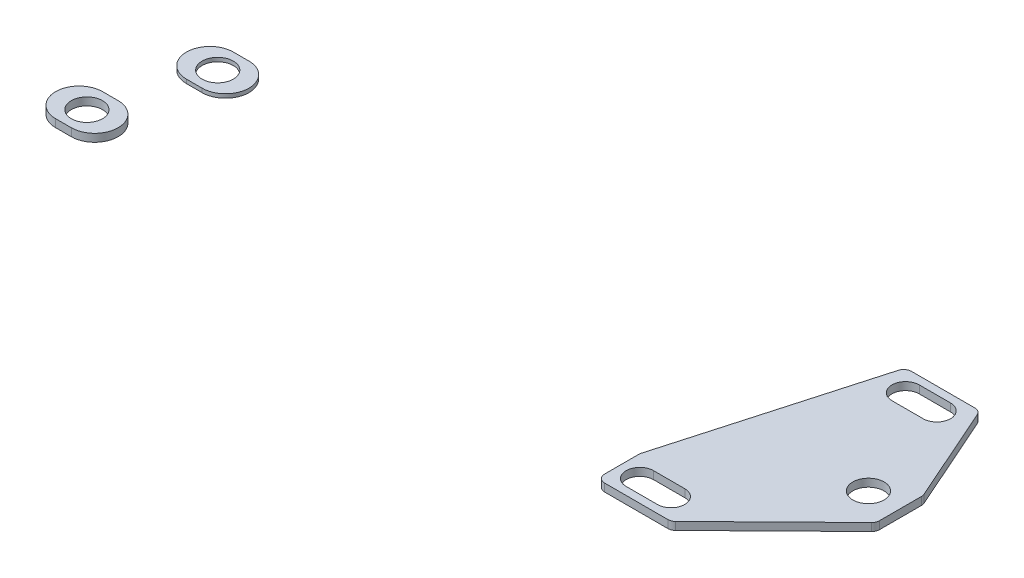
from build123d import *
from build123d.topology import SkipClean

# Parameters (mm, degrees)
AUFSATZ_LINEAR_AUSTRAGEN1_DEPTH   = 1
AUFSATZ_LINEAR_AUSTRAGEN2_DEPTH   = 1
AUFSATZ_LINEAR_AUSTRAGEN2_2_DEPTH = 1
AUFSATZ_LINEAR_AUSTRAGEN3_DEPTH   = 1
AUFSATZ_LINEAR_AUSTRAGEN3_2_DEPTH = 1
BOSS_EXTRUDE2_DEPTH               = 11
SKETCH3_W                         = 3
SKETCH3_H                         = 8
CUT_EXTRUDE2_DEPTH                = 1
SKETCH4_W                         = 3
SKETCH4_H                         = 8
CUT_EXTRUDE3_DEPTH                = 9
SKETCH6_W                         = 3
SKETCH6_H                         = 8
BOSS_EXTRUDE3_DEPTH               = 2
SKETCH8_W                         = 8
SKETCH8_H                         = 7
BOSS_EXTRUDE8_DEPTH               = 11
BOSS_EXTRUDE9_DEPTH               = 2
SKETCH9_W                         = 8
SKETCH9_H                         = 7
CUT_EXTRUDE4_DEPTH                = 11
SKETCH10_W                        = 3
SKETCH10_H                        = 8
BOSS_EXTRUDE10_DEPTH              = 2
SKETCH11_R                        = 3
CUT_EXTRUDE5_DEPTH                = 98.08758932
SKETCH12_R                        = 3
CUT_EXTRUDE6_DEPTH                = 98.473073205
SKETCH14_R                        = 3
CUT_EXTRUDE8_DEPTH                = 1
CUT_EXTRUDE9_DEPTH                = 98.205966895
FILLET3_R                         = 2
SKETCH18_W                        = 50.195530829
SKETCH18_H                        = 34.155605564
CUT_EXTRUDE10_DEPTH               = 1
SKETCH20_W                        = 50.179105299
SKETCH20_H                        = 58.102121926
CUT_EXTRUDE11_DEPTH               = 1
BOSS_EXTRUDE11_DEPTH              = 2
CUT_EXTRUDE12_DEPTH               = 2
SKETCH23_W                        = 35.69545505
SKETCH23_H                        = 16.05523492
CUT_EXTRUDE13_DEPTH               = 1
SKETCH24_R                        = 3
BOSS_EXTRUDE12_DEPTH              = 1
SKETCH25_R                        = 4
CUT_EXTRUDE14_DEPTH               = 102.959780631
SKETCH26_R                        = 4
BOSS_EXTRUDE13_DEPTH              = 5
BOSS_EXTRUDE14_DEPTH              = 1
BOSS_EXTRUDE14_DEPTH_BACK         = 1
SKETCH28_W                        = 16
SKETCH28_H                        = 12
CUT_EXTRUDE16_DEPTH               = 1
SKETCH29_R                        = 4
CUT_EXTRUDE17_DEPTH               = 103.668382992
CUT_EXTRUDE18_DEPTH               = 102.959780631
BOSS_EXTRUDE15_DEPTH              = 1
BOSS_EXTRUDE15_DEPTH_BACK         = 2
SKETCH33_W                        = 16
SKETCH33_H                        = 12
CUT_EXTRUDE19_DEPTH               = 1
SKETCH34_R                        = 4
SKETCH34_R_2                      = 3
CUT_EXTRUDE20_DEPTH               = 105.499401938
CUT_EXTRUDE22_DEPTH               = 281


with BuildPart() as part:
    # Trinity heel → Aufsatz-Linear austragen1 (new body)
    with BuildSketch(Plane(origin=(0, 0, 0), x_dir=(1, 0, 0), z_dir=(0, 1, 0))):
        with BuildLine():
            Line((-82, 3.5), (-74, 3.5))
            ThreePointArc((-74, 3.5), (-70.5, 0), (-74, -3.5))
            Line((-74, -3.5), (-82, -3.5))
            ThreePointArc((-82, -3.5), (-85.5, 0), (-82, 3.5))
        make_face()
    extrude(amount=-AUFSATZ_LINEAR_AUSTRAGEN1_DEPTH)



with BuildPart() as body_2:
    # Trinity front → Aufsatz-Linear austragen2 (new body)
    with BuildSketch(Plane(origin=(0, -11, 0), x_dir=(1, 0, 0), z_dir=(0, 1, 0))):
        with BuildLine():
            Line((66, 30), (74, 30))
            ThreePointArc((74, 30), (77.5, 26.5), (74, 23))
            Line((74, 23), (66, 23))
            ThreePointArc((66, 23), (62.5, 26.5), (66, 30))
        make_face()
    extrude(amount=-AUFSATZ_LINEAR_AUSTRAGEN2_DEPTH)



with BuildPart() as body_3:
    # Trinity front → Aufsatz-Linear austragen2 2 (new body)
    with BuildSketch(Plane(origin=(0, -11, 0), x_dir=(1, 0, 0), z_dir=(0, 1, 0))):
        with BuildLine():
            Line((51, -23), (59, -23))
            ThreePointArc((59, -23), (62.5, -26.5), (59, -30))
            Line((59, -30), (51, -30))
            ThreePointArc((51, -30), (47.5, -26.5), (51, -23))
        make_face()
    extrude(amount=-AUFSATZ_LINEAR_AUSTRAGEN2_2_DEPTH)


with BuildPart() as body_4:
    # UFS → Aufsatz-Linear austragen3 (new body)
    with BuildSketch(Plane(origin=(0, 0, 0), x_dir=(1, 0, 0), z_dir=(0, 1, 0))):
        with BuildLine():
            Line((-85, 4), (-82, 4))
            ThreePointArc((-82, 4), (-78, 0), (-82, -4))
            Line((-82, -4), (-85, -4))
            ThreePointArc((-85, -4), (-89, 0), (-85, 4))
        make_face()
    extrude(amount=-AUFSATZ_LINEAR_AUSTRAGEN3_DEPTH)


with BuildPart() as body_5:
    # UFS → Aufsatz-Linear austragen3 2 (new body)
    with BuildSketch(Plane(origin=(0, 0, 0), x_dir=(1, 0, 0), z_dir=(0, 1, 0))):
        with BuildLine():
            Line((82, 4), (85, 4))
            ThreePointArc((85, 4), (89, 0), (85, -4))
            Line((85, -4), (82, -4))
            ThreePointArc((82, -4), (78, 0), (82, 4))
        make_face()
    extrude(amount=-AUFSATZ_LINEAR_AUSTRAGEN3_2_DEPTH)

    # Sketch2 → Boss-Extrude2 (add)
    with BuildSketch(Plane(origin=(0, 0, 0), x_dir=(1, 0, 0), z_dir=(0, 1, 0))):
        with BuildLine():
            Line((85, -4), (82, -4))
            ThreePointArc((82, -4), (78, 0), (82, 4))
            Line((82, 4), (85, 4))
            ThreePointArc((85, 4), (89, 0), (85, -4))
        make_face()
    extrude(amount=-BOSS_EXTRUDE2_DEPTH)

    # Sketch3 → Cut-Extrude2 (cut)
    with BuildSketch(Plane.XZ.offset(11)):
        with BuildLine():
            Line((85, -4), (85, 4))
            ThreePointArc((85, 4), (89, 0), (85, -4))
        make_face()
        with Locations((83.5, 0)):
            Rectangle(SKETCH3_W, SKETCH3_H)
        with BuildLine():
            Line((82, 4), (82, -4))
            ThreePointArc((82, -4), (78, 0), (82, 4))
        make_face()
    extrude(amount=-CUT_EXTRUDE2_DEPTH, mode=Mode.SUBTRACT)

    # Sketch4 → Cut-Extrude3 (cut)
    with BuildSketch(Plane(origin=(0, 0, 0), x_dir=(1, 0, 0), z_dir=(0, 1, 0))):
        with BuildLine():
            Line((85, 4), (85, -4))
            ThreePointArc((85, -4), (89, 0), (85, 4))
        make_face()
        with Locations((83.5, 0)):
            Rectangle(SKETCH4_W, SKETCH4_H)
        with BuildLine():
            Line((82, -4), (82, 4))
            ThreePointArc((82, 4), (78, 0), (82, -4))
        make_face()
    extrude(amount=-CUT_EXTRUDE3_DEPTH, mode=Mode.SUBTRACT)

    # Sketch6 → Boss-Extrude3 (add)
    with BuildSketch(Plane(origin=(0, -10, 0), x_dir=(-1, 0, 0), z_dir=(0, -1, 0))):
        with BuildLine():
            Line((-85, -4), (-85, 4))
            ThreePointArc((-85, 4), (-89, 0), (-85, -4))
        make_face()
        with Locations((-83.5, 0)):
            Rectangle(SKETCH6_W, SKETCH6_H)
        with BuildLine():
            Line((-82, -4), (-82, 4))
            ThreePointArc((-82, 4), (-78, 0), (-82, -4))
        make_face()
    extrude(amount=BOSS_EXTRUDE3_DEPTH)


with BuildPart() as body_2_1:
    add(body_2.part)

    add(body_3.part)  # Boss-Extrude8 merges body 3
    # Sketch8 → Boss-Extrude8 (add)
    with BuildSketch(Plane.XZ.offset(12)):
        with BuildLine():
            Line((74, -23), (74, -30))
            ThreePointArc((74, -30), (77.5, -26.5), (74, -23))
        make_face()
        with Locations((70, -26.5)):
            Rectangle(SKETCH8_W, SKETCH8_H)
        with BuildLine():
            Line((66, -23), (66, -30))
            ThreePointArc((66, -30), (62.5, -26.5), (66, -23))
        make_face()
        with BuildLine():
            ThreePointArc((59, 30), (62.5, 26.5), (59, 23))
            Line((59, 23), (59, 30))
        make_face()
        with Locations((55, 26.5)):
            Rectangle(SKETCH8_W, SKETCH8_H)
        with BuildLine():
            Line((51, 30), (51, 23))
            ThreePointArc((51, 23), (47.5, 26.5), (51, 30))
        make_face()
    extrude(amount=-BOSS_EXTRUDE8_DEPTH)


    add(body_5.part)  # Boss-Extrude9 merges body 5
    # Sketch7 → Boss-Extrude9 (add)
    with BuildSketch(Plane(origin=(0, -12, 0), x_dir=(-1, 0, 0), z_dir=(0, -1, 0))):
        Polygon((-45.5, -21), (-45.5, -32), (-64.5, -32), (-91, -6), (-91, 6), (-79.5, 32), (-60.5, 32), align=None)
        with BuildLine():
            Line((-74, 30), (-66, 30))
            ThreePointArc((-66, 30), (-62.5, 26.5), (-66, 23))
            Line((-66, 23), (-74, 23))
            ThreePointArc((-74, 23), (-77.5, 26.5), (-74, 30))
        make_face(mode=Mode.SUBTRACT)
        with BuildLine():
            ThreePointArc((-51, -30), (-47.5, -26.5), (-51, -23))
            Line((-51, -23), (-59, -23))
            ThreePointArc((-59, -23), (-62.5, -26.5), (-59, -30))
            Line((-59, -30), (-51, -30))
        make_face(mode=Mode.SUBTRACT)
    extrude(amount=-BOSS_EXTRUDE9_DEPTH)

    # Sketch9 → Cut-Extrude4 (cut)
    with BuildSketch(Plane(origin=(0, -1, 0), x_dir=(1, 0, 0), z_dir=(0, 1, 0))):
        with BuildLine():
            Line((74, 30), (74, 23))
            ThreePointArc((74, 23), (77.5, 26.5), (74, 30))
        make_face()
        with Locations((70, 26.5)):
            Rectangle(SKETCH9_W, SKETCH9_H)
        with BuildLine():
            Line((66, 23), (66, 30))
            ThreePointArc((66, 30), (62.5, 26.5), (66, 23))
        make_face()
        with BuildLine():
            ThreePointArc((59, -23), (62.5, -26.5), (59, -30))
            Line((59, -30), (59, -23))
        make_face()
        with Locations((55, -26.5)):
            Rectangle(SKETCH9_W, SKETCH9_H)
        with BuildLine():
            Line((51, -30), (51, -23))
            ThreePointArc((51, -23), (47.5, -26.5), (51, -30))
        make_face()
    extrude(amount=-CUT_EXTRUDE4_DEPTH, mode=Mode.SUBTRACT)

    # Sketch11 → Cut-Extrude5 (cut, through all)
    with BuildSketch(Plane(origin=(0, -9, 0), x_dir=(1, 0, 0), z_dir=(0, 1, 0))):
        with Locations(Location((83, 0, 0), (0, 0, 270))):
            Circle(SKETCH11_R)
    extrude(amount=-CUT_EXTRUDE5_DEPTH, mode=Mode.SUBTRACT)

    # Sketch14 → Cut-Extrude8 (cut)
    with BuildSketch(Plane(origin=(0, -9, 0), x_dir=(1, 0, 0), z_dir=(0, 1, 0))):
        with Locations(Location((83, 0, 0), (0, 0, 270))):
            Circle(SKETCH14_R)
        with BuildLine():
            Line((82, -4), (82, 4))
            ThreePointArc((82, 4), (78, 0), (82, -4))
        make_face()
        with BuildLine():
            Line((85, 4), (82, 4))
            Line((82, 4), (82, 2.828427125))
            ThreePointArc((82, 2.828427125), (83.58113883, 2.943174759), (85, 2.236067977))
            Line((85, 2.236067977), (85, 4))
        make_face()
        with Locations(Location((83, 0, 0), (0, 0, 270))):
            Circle(SKETCH14_R)
        with BuildLine():
            Line((85, 4), (85, -4))
            ThreePointArc((85, -4), (89, 0), (85, 4))
        make_face()
        with BuildLine():
            Line((82, -2.828427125), (82, -4))
            Line((82, -4), (85, -4))
            Line((85, -4), (85, -2.236067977))
            ThreePointArc((85, -2.236067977), (83.58113883, -2.943174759), (82, -2.828427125))
        make_face()
    extrude(amount=-CUT_EXTRUDE8_DEPTH, mode=Mode.SUBTRACT)

    # Fillet3
    fillet3_edges = [body_2_1.edges().sort_by_distance(p)[0] for p in [
        (60.5, -11, -32),
        (45.5, -11, 21),
        (45.5, -11, 32),
        (64.5, -11, 32),
        (91, -11, 6),
        (91, -11, -6),
        (79.5, -11, -32),
    ]]
    fillet(fillet3_edges, radius=FILLET3_R)

    # Sketch25 → Cut-Extrude14 (cut, through all)
    with BuildSketch(Plane(origin=(0, 0, 0), x_dir=(1, 0, 0), z_dir=(0, 1, 0))):
        with Locations(Location((83, 0, 0), (0, 0, 270))):
            Circle(SKETCH25_R)
    extrude(amount=-CUT_EXTRUDE14_DEPTH, mode=Mode.SUBTRACT)


with BuildPart() as part_1:
    add(part.part)

    add(body_4.part)  # Boss-Extrude10 merges body 4
    # Sketch10 → Boss-Extrude10 (add)
    with BuildSketch(Plane(origin=(0, 0, 0), x_dir=(1, 0, 0), z_dir=(0, 1, 0))):
        with BuildLine():
            Line((-82, 4), (-82, -4))
            ThreePointArc((-82, -4), (-78, 0), (-82, 4))
        make_face()
        with Locations((-83.5, 0)):
            Rectangle(SKETCH10_W, SKETCH10_H)
        with BuildLine():
            Line((-85, -4), (-85, 4))
            ThreePointArc((-85, 4), (-89, 0), (-85, -4))
        make_face()
    extrude(amount=BOSS_EXTRUDE10_DEPTH)

    # Sketch12 → Cut-Extrude6 (cut, through all)
    with BuildSketch(Plane(origin=(0, 2, 0), x_dir=(1, 0, 0), z_dir=(0, 1, 0))):
        with Locations(Location((-83.5, 0, 0), (0, 0, 270))):
            Circle(SKETCH12_R)
    extrude(amount=-CUT_EXTRUDE6_DEPTH, mode=Mode.SUBTRACT)

    # Sketch15 → Cut-Extrude9 (cut, through all)
    with SkipClean():  # the faces are left unmerged after this step: merging them gives an invalid solid
        with BuildSketch(Plane(origin=(0, 0, 0), x_dir=(1, 0, 0), z_dir=(0, 1, 0))):
            with BuildLine():
                Line((-74, 3.5), (-74, -3.5))
                Line((-74, -3.5), (-80.063508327, -3.5))
                ThreePointArc((-80.063508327, -3.5), (-78, 0), (-80.063508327, 3.5))
                Line((-80.063508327, 3.5), (-74, 3.5))
            make_face()
            with BuildLine():
                Line((-74, 3.5), (-74, -3.5))
                ThreePointArc((-74, -3.5), (-70.5, 0), (-74, 3.5))
            make_face()
        extrude(amount=-CUT_EXTRUDE9_DEPTH, mode=Mode.SUBTRACT)

    # Sketch18 → Cut-Extrude10 (cut)
    with SkipClean():  # the faces are left unmerged after this step: merging them gives an invalid solid
        with BuildSketch(Plane(origin=(0, 2, 0), x_dir=(1, 0, 0), z_dir=(0, 1, 0))):
            with Locations((-88.608603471, 1.320935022)):
                Rectangle(SKETCH18_W, SKETCH18_H)
        extrude(amount=-CUT_EXTRUDE10_DEPTH, mode=Mode.SUBTRACT)

    # Sketch20 → Cut-Extrude11 (cut)
    with SkipClean():  # the faces are left unmerged after this step: merging them gives an invalid solid
        with BuildSketch(Plane(origin=(0, 1, 0), x_dir=(1, 0, 0), z_dir=(0, 1, 0))):
            with Locations((-87.446627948, -8.329824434)):
                Rectangle(SKETCH20_W, SKETCH20_H)
        extrude(amount=-CUT_EXTRUDE11_DEPTH, mode=Mode.SUBTRACT)

    # Sketch26 → Boss-Extrude13 (add)
    with SkipClean():  # the faces are left unmerged after this step: merging them gives an invalid solid
        with BuildSketch(Plane(origin=(0, 0, 0), x_dir=(1, 0, 0), z_dir=(0, 1, 0))):
            with Locations(Location((-83.5, 0, 0), (0, 0, 270))):
                Circle(SKETCH26_R)
        extrude(amount=BOSS_EXTRUDE13_DEPTH)

    # Sketch27 → Boss-Extrude14 (add, two sides: drawn at the far end of the back side and taken through both)
    with BuildSketch(Plane(origin=(0, -1, 0), x_dir=(-1, 0, 0), z_dir=(0, -1, 0)).offset(-BOSS_EXTRUDE14_DEPTH_BACK)):
        with BuildLine():
            Line((82, 4), (83.5, 4))
            Line((83.5, 4), (83.5, 6))
            Line((83.5, 6), (75.5, 6))
            Line((75.5, 6), (75.5, -6))
            Line((75.5, -6), (83.5, -6))
            Line((83.5, -6), (83.5, -4))
            Line((83.5, -4), (82, -4))
            ThreePointArc((82, -4), (78, 0), (82, 4))
        make_face()
        with BuildLine():
            Line((83.5, 6), (83.5, 4))
            Line((83.5, 4), (85, 4))
            ThreePointArc((85, 4), (89, 0), (85, -4))
            Line((85, -4), (83.5, -4))
            Line((83.5, -4), (83.5, -6))
            Line((83.5, -6), (91.5, -6))
            Line((91.5, -6), (91.5, 6))
            Line((91.5, 6), (83.5, 6))
        make_face()
        with BuildLine():
            Line((83.5, 4), (83.5, 3))
            ThreePointArc((83.5, 3), (85.621320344, 2.121320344), (86.5, 0))
            ThreePointArc((86.5, 0), (85.621320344, -2.121320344), (83.5, -3))
            Line((83.5, -3), (83.5, -4))
            Line((83.5, -4), (85, -4))
            ThreePointArc((85, -4), (89, 0), (85, 4))
            Line((85, 4), (83.5, 4))
        make_face()
        with BuildLine():
            ThreePointArc((83.5, -3), (80.5, 0), (83.5, 3))
            Line((83.5, 3), (83.5, 4))
            Line((83.5, 4), (82, 4))
            ThreePointArc((82, 4), (78, 0), (82, -4))
            Line((82, -4), (83.5, -4))
            Line((83.5, -4), (83.5, -3))
        make_face()
        with BuildLine():
            Line((83.5, -3), (83.5, 0))
            Line((83.5, 0), (83.5, 3))
            ThreePointArc((83.5, 3), (80.5, 0), (83.5, -3))
        make_face()
        with BuildLine():
            Line((83.5, 3), (83.5, 0))
            Line((83.5, 0), (83.5, -3))
            ThreePointArc((83.5, -3), (85.621320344, -2.121320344), (86.5, 0))
            ThreePointArc((86.5, 0), (85.621320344, 2.121320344), (83.5, 3))
        make_face()
        with BuildLine():
            Line((83.5, -3), (83.5, 0))
            Line((83.5, 0), (83.5, 3))
            ThreePointArc((83.5, 3), (80.5, 0), (83.5, -3))
        make_face()
        with BuildLine():
            Line((83.5, 3), (83.5, 0))
            Line((83.5, 0), (83.5, -3))
            ThreePointArc((83.5, -3), (85.621320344, -2.121320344), (86.5, 0))
            ThreePointArc((86.5, 0), (85.621320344, 2.121320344), (83.5, 3))
        make_face()
    extrude(amount=BOSS_EXTRUDE14_DEPTH + BOSS_EXTRUDE14_DEPTH_BACK)

    # Sketch28 → Cut-Extrude16 (cut)
    with BuildSketch(Plane(origin=(0, -2, 0), x_dir=(-1, 0, 0), z_dir=(0, -1, 0))):
        with Locations((83.5, 0)):
            Rectangle(SKETCH28_W, SKETCH28_H)
    extrude(amount=-CUT_EXTRUDE16_DEPTH, mode=Mode.SUBTRACT)

    # Sketch29 → Cut-Extrude17 (cut, through all)
    with BuildSketch(Plane(origin=(0, 5, 0), x_dir=(1, 0, 0), z_dir=(0, 1, 0))):
        with Locations(Location((-83.5, 0, 0), (0, 0, 270))):
            Circle(SKETCH29_R)
    extrude(amount=-CUT_EXTRUDE17_DEPTH, mode=Mode.SUBTRACT)

    # Sketch31 → Cut-Extrude18 (cut, through all)
    with BuildSketch(Plane(origin=(0, 0, 0), x_dir=(1, 0, 0), z_dir=(0, 1, 0))):
        with BuildLine():
            Line((-75.5, 6), (-81.5, 6))
            ThreePointArc((-81.5, 6), (-77.257359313, 4.242640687), (-75.5, 0))
            Line((-75.5, 0), (-75.5, 6))
        make_face()
        with BuildLine():
            Line((-75.5, -6), (-75.5, 0))
            ThreePointArc((-75.5, 0), (-77.257359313, -4.242640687), (-81.5, -6))
            Line((-81.5, -6), (-75.5, -6))
        make_face()
        with BuildLine():
            ThreePointArc((-91.5, 0), (-89.742640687, 4.242640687), (-85.5, 6))
            Line((-85.5, 6), (-91.5, 6))
            Line((-91.5, 6), (-91.5, 0))
        make_face()
        with BuildLine():
            ThreePointArc((-85.5, -6), (-89.742640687, -4.242640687), (-91.5, 0))
            Line((-91.5, 0), (-91.5, -6))
            Line((-91.5, -6), (-85.5, -6))
        make_face()
        with BuildLine():
            ThreePointArc((-87.5, 0), (-83.5, -4), (-79.5, 0))
            Line((-79.5, 0), (-83.5, 0))
            Line((-83.5, 0), (-87.5, 0))
        make_face()
        with BuildLine():
            Line((-83.5, 0), (-79.5, 0))
            ThreePointArc((-79.5, 0), (-83.5, 4), (-87.5, 0))
            Line((-87.5, 0), (-83.5, 0))
        make_face()
        with BuildLine():
            ThreePointArc((-87.5, 0), (-83.5, -4), (-79.5, 0))
            Line((-79.5, 0), (-83.5, 0))
            Line((-83.5, 0), (-87.5, 0))
        make_face()
        with BuildLine():
            Line((-83.5, 0), (-79.5, 0))
            ThreePointArc((-79.5, 0), (-83.5, 4), (-87.5, 0))
            Line((-87.5, 0), (-83.5, 0))
        make_face()
    extrude(amount=-CUT_EXTRUDE18_DEPTH, mode=Mode.SUBTRACT)


with BuildPart() as body_3_2:
    # Sketch21 → Boss-Extrude11 (new body)
    with BuildSketch(Plane(origin=(0, 0, 0), x_dir=(1, 0, 0), z_dir=(0, 1, 0))):
        with BuildLine():
            Line((-89.061422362, -22.49904731), (-92.061422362, -22.49904731))
            ThreePointArc((-92.061422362, -22.49904731), (-96.061422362, -26.49904731), (-92.061422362, -30.49904731))
            Line((-92.061422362, -30.49904731), (-89.061422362, -30.49904731))
            ThreePointArc((-89.061422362, -30.49904731), (-85.061422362, -26.49904731), (-89.061422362, -22.49904731))
        make_face()
    extrude(amount=BOSS_EXTRUDE11_DEPTH)

    # Sketch22 → Cut-Extrude12 (cut)
    with BuildSketch(Plane(origin=(0, 2, 0), x_dir=(1, 0, 0), z_dir=(0, 1, 0))):
        with BuildLine():
            ThreePointArc((-87.462870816, -26.49904731), (-87.893401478, -24.95055536), (-89.061422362, -23.846512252))
            Line((-89.061422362, -23.846512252), (-89.061422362, -26.49904731))
            Line((-89.061422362, -26.49904731), (-91.86431927, -26.49904731))
            Line((-91.86431927, -26.49904731), (-93.462870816, -26.49904731))
            ThreePointArc((-93.462870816, -26.49904731), (-90.462870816, -29.49904731), (-87.462870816, -26.49904731))
        make_face()
        with BuildLine():
            Line((-89.061422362, -26.49904731), (-89.061422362, -23.846512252))
            ThreePointArc((-89.061422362, -23.846512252), (-90.462870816, -23.49904731), (-91.86431927, -23.846512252))
            Line((-91.86431927, -23.846512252), (-91.86431927, -26.49904731))
            Line((-91.86431927, -26.49904731), (-89.061422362, -26.49904731))
        make_face()
        with BuildLine():
            Line((-91.86431927, -26.49904731), (-91.86431927, -23.846512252))
            ThreePointArc((-91.86431927, -23.846512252), (-93.032340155, -24.95055536), (-93.462870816, -26.49904731))
            Line((-93.462870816, -26.49904731), (-91.86431927, -26.49904731))
        make_face()
    extrude(amount=-CUT_EXTRUDE12_DEPTH, mode=Mode.SUBTRACT)

    # Sketch23 → Cut-Extrude13 (cut)
    with BuildSketch(Plane(origin=(0, 2, 0), x_dir=(1, 0, 0), z_dir=(0, 1, 0))):
        with Locations((-92.020284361, -27.047059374)):
            Rectangle(SKETCH23_W, SKETCH23_H)
    extrude(amount=-CUT_EXTRUDE13_DEPTH, mode=Mode.SUBTRACT)

    # Sketch24 → Boss-Extrude12 (add)
    with SkipClean():  # the faces are left unmerged after this step: merging them gives an invalid solid
        with BuildSketch(Plane(origin=(0, 0, 0), x_dir=(-1, 0, 0), z_dir=(0, -1, 0))):
            with BuildLine():
                ThreePointArc((89.061422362, -22.49904731), (85.061422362, -26.49904731), (89.061422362, -30.49904731))
                Line((89.061422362, -30.49904731), (92.061422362, -30.49904731))
                ThreePointArc((92.061422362, -30.49904731), (96.061422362, -26.49904731), (92.061422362, -22.49904731))
                Line((92.061422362, -22.49904731), (89.061422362, -22.49904731))
            make_face()
            with Locations((90.462870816, -26.49904731)):
                Circle(SKETCH24_R, mode=Mode.SUBTRACT)
        extrude(amount=BOSS_EXTRUDE12_DEPTH)

    # Sketch32 → Boss-Extrude15 (add, two sides: drawn at the far end of the back side and taken through both)
    with SkipClean():  # the faces are left unmerged after this step: merging them gives an invalid solid
        with BuildSketch(Plane(origin=(0, 1, 0), x_dir=(1, 0, 0), z_dir=(0, 1, 0)).offset(-BOSS_EXTRUDE15_DEPTH_BACK)):
            with BuildLine():
                Line((-92.061422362, -22.49904731), (-90.462870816, -22.49904731))
                Line((-90.462870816, -22.49904731), (-90.462870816, -20.49904731))
                Line((-90.462870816, -20.49904731), (-98.462870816, -20.49904731))
                Line((-98.462870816, -20.49904731), (-98.462870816, -32.49904731))
                Line((-98.462870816, -32.49904731), (-90.462870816, -32.49904731))
                Line((-90.462870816, -32.49904731), (-90.462870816, -30.49904731))
                Line((-90.462870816, -30.49904731), (-92.061422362, -30.49904731))
                ThreePointArc((-92.061422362, -30.49904731), (-96.061422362, -26.49904731), (-92.061422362, -22.49904731))
            make_face()
            with BuildLine():
                Line((-90.462870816, -20.49904731), (-90.462870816, -22.49904731))
                Line((-90.462870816, -22.49904731), (-89.061422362, -22.49904731))
                ThreePointArc((-89.061422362, -22.49904731), (-85.061422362, -26.49904731), (-89.061422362, -30.49904731))
                Line((-89.061422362, -30.49904731), (-90.462870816, -30.49904731))
                Line((-90.462870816, -30.49904731), (-90.462870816, -32.49904731))
                Line((-90.462870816, -32.49904731), (-82.462870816, -32.49904731))
                Line((-82.462870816, -32.49904731), (-82.462870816, -20.49904731))
                Line((-82.462870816, -20.49904731), (-90.462870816, -20.49904731))
            make_face()
        extrude(amount=BOSS_EXTRUDE15_DEPTH + BOSS_EXTRUDE15_DEPTH_BACK)

    # Sketch33 → Cut-Extrude19 (cut)
    with SkipClean():  # the faces are left unmerged after this step: merging them gives an invalid solid
        with BuildSketch(Plane(origin=(0, 2, 0), x_dir=(1, 0, 0), z_dir=(0, 1, 0))):
            with Locations((-90.462870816, -26.49904731)):
                Rectangle(SKETCH33_W, SKETCH33_H)
        extrude(amount=-CUT_EXTRUDE19_DEPTH, mode=Mode.SUBTRACT)

    # Sketch34 → Cut-Extrude20 (cut, through all)
    # profile 1 of 8: a face of its own
    with BuildSketch(Plane(origin=(0, 1, 0), x_dir=(1, 0, 0), z_dir=(0, 1, 0))):
        with Locations(Location((-90.462870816, -26.49904731, 0), (0, 0, 270))):
            Circle(SKETCH34_R)
        with Locations((-90.462870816, -26.49904731)):
            Circle(SKETCH34_R_2, mode=Mode.SUBTRACT)
    # profile 2 of 8: a face of its own
    with BuildSketch(Plane(origin=(0, 1, 0), x_dir=(1, 0, 0), z_dir=(0, 1, 0))):
        with BuildLine():
            ThreePointArc((-87.462870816, -26.49904731), (-88.341550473, -24.377726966), (-90.462870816, -23.49904731))
            Line((-90.462870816, -23.49904731), (-90.462870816, -26.49904731))
            Line((-90.462870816, -26.49904731), (-87.462870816, -26.49904731))
        make_face()
    # profile 3 of 8: a face of its own
    with BuildSketch(Plane(origin=(0, 1, 0), x_dir=(1, 0, 0), z_dir=(0, 1, 0))):
        Polygon((-87.462870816, -26.49904731), (-90.462870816, -26.49904731), (-90.462870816, -29.49904731), align=None)
    # profile 4 of 8: a face of its own
    with BuildSketch(Plane(origin=(0, 1, 0), x_dir=(1, 0, 0), z_dir=(0, 1, 0))):
        with BuildLine():
            ThreePointArc((-90.462870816, -29.49904731), (-88.341550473, -28.620367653), (-87.462870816, -26.49904731))
            Line((-87.462870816, -26.49904731), (-90.462870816, -29.49904731))
        make_face()
    # profile 5 of 8: a face of its own
    with BuildSketch(Plane(origin=(0, 1, 0), x_dir=(1, 0, 0), z_dir=(0, 1, 0))):
        with BuildLine():
            Line((-90.462870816, -26.49904731), (-90.462870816, -23.49904731))
            ThreePointArc((-90.462870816, -23.49904731), (-92.58419116, -24.377726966), (-93.462870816, -26.49904731))
            Line((-93.462870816, -26.49904731), (-90.462870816, -26.49904731))
        make_face()
    # profile 6 of 8: a face of its own
    with BuildSketch(Plane(origin=(0, 1, 0), x_dir=(1, 0, 0), z_dir=(0, 1, 0))):
        with BuildLine():
            Line((-90.462870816, -29.49904731), (-90.462870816, -26.49904731))
            Line((-90.462870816, -26.49904731), (-93.462870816, -26.49904731))
            ThreePointArc((-93.462870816, -26.49904731), (-92.58419116, -28.620367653), (-90.462870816, -29.49904731))
        make_face()
    # profile 7 of 8: a face of its own
    with BuildSketch(Plane(origin=(0, 1, 0), x_dir=(1, 0, 0), z_dir=(0, 1, 0))):
        with BuildLine():
            Line((-90.462870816, -26.49904731), (-90.462870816, -23.49904731))
            ThreePointArc((-90.462870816, -23.49904731), (-92.58419116, -24.377726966), (-93.462870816, -26.49904731))
            Line((-93.462870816, -26.49904731), (-90.462870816, -26.49904731))
        make_face()
    # profile 8 of 8: a face of its own
    with BuildSketch(Plane(origin=(0, 1, 0), x_dir=(1, 0, 0), z_dir=(0, 1, 0))):
        with BuildLine():
            Line((-90.462870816, -29.49904731), (-90.462870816, -26.49904731))
            Line((-90.462870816, -26.49904731), (-93.462870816, -26.49904731))
            ThreePointArc((-93.462870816, -26.49904731), (-92.58419116, -28.620367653), (-90.462870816, -29.49904731))
        make_face()
    extrude(amount=-CUT_EXTRUDE20_DEPTH, mode=Mode.SUBTRACT)

    # Sketch35 → Cut-Extrude22 (cut)
    with BuildSketch(Plane(origin=(0, 1, 0), x_dir=(1, 0, 0), z_dir=(0, 1, 0))):
        with BuildLine():
            Line((-82.462870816, -20.49904731), (-88.462870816, -20.49904731))
            ThreePointArc((-88.462870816, -20.49904731), (-84.220230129, -22.256406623), (-82.462870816, -26.49904731))
            Line((-82.462870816, -26.49904731), (-82.462870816, -20.49904731))
        make_face()
        with BuildLine():
            ThreePointArc((-82.462870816, -26.49904731), (-84.220230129, -30.741687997), (-88.462870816, -32.49904731))
            Line((-88.462870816, -32.49904731), (-82.462870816, -32.49904731))
            Line((-82.462870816, -32.49904731), (-82.462870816, -26.49904731))
        make_face()
        with BuildLine():
            Line((-98.462870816, -32.49904731), (-92.462870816, -32.49904731))
            ThreePointArc((-92.462870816, -32.49904731), (-96.705511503, -30.741687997), (-98.462870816, -26.49904731))
            Line((-98.462870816, -26.49904731), (-98.462870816, -32.49904731))
        make_face()
        with BuildLine():
            ThreePointArc((-98.462870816, -26.49904731), (-96.705511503, -22.256406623), (-92.462870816, -20.49904731))
            Line((-92.462870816, -20.49904731), (-98.462870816, -20.49904731))
            Line((-98.462870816, -20.49904731), (-98.462870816, -26.49904731))
        make_face()
        with BuildLine():
            Line((-90.462870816, -26.49904731), (-90.462870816, -22.49904731))
            ThreePointArc((-90.462870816, -22.49904731), (-93.291297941, -23.670620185), (-94.462870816, -26.49904731))
            Line((-94.462870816, -26.49904731), (-90.462870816, -26.49904731))
        make_face()
        with BuildLine():
            Line((-90.462870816, -30.49904731), (-90.462870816, -26.49904731))
            Line((-90.462870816, -26.49904731), (-94.462870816, -26.49904731))
            ThreePointArc((-94.462870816, -26.49904731), (-93.291297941, -29.327474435), (-90.462870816, -30.49904731))
        make_face()
        with BuildLine():
            ThreePointArc((-86.462870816, -26.49904731), (-87.634443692, -23.670620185), (-90.462870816, -22.49904731))
            Line((-90.462870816, -22.49904731), (-90.462870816, -26.49904731))
            Line((-90.462870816, -26.49904731), (-86.462870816, -26.49904731))
        make_face()
        Polygon((-86.462870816, -26.49904731), (-90.462870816, -26.49904731), (-90.462870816, -30.49904731), align=None)
        with BuildLine():
            ThreePointArc((-90.462870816, -30.49904731), (-87.634443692, -29.327474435), (-86.462870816, -26.49904731))
            Line((-86.462870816, -26.49904731), (-90.462870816, -30.49904731))
        make_face()
        with BuildLine():
            Line((-90.462870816, -26.49904731), (-90.462870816, -22.49904731))
            ThreePointArc((-90.462870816, -22.49904731), (-93.291297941, -23.670620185), (-94.462870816, -26.49904731))
            Line((-94.462870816, -26.49904731), (-90.462870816, -26.49904731))
        make_face()
        with BuildLine():
            Line((-90.462870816, -30.49904731), (-90.462870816, -26.49904731))
            Line((-90.462870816, -26.49904731), (-94.462870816, -26.49904731))
            ThreePointArc((-94.462870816, -26.49904731), (-93.291297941, -29.327474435), (-90.462870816, -30.49904731))
        make_face()
    extrude(amount=-CUT_EXTRUDE22_DEPTH, mode=Mode.SUBTRACT)


solid = Compound([body_2_1.part, part_1.part, body_3_2.part])
